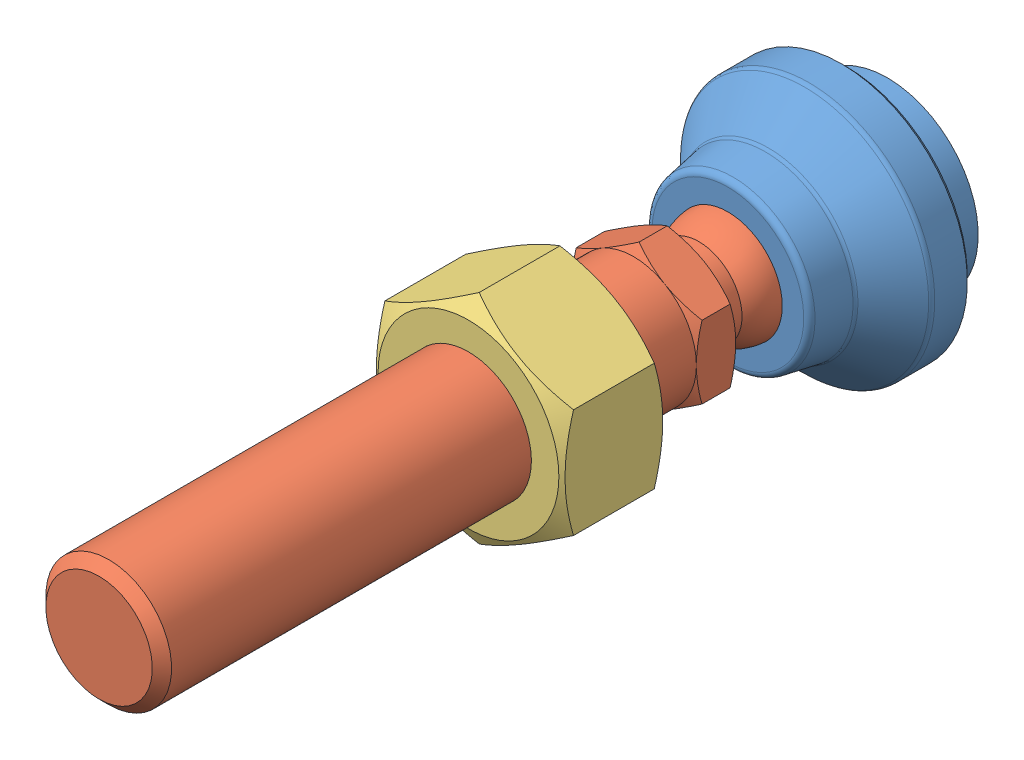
SolidWorks assembly LSVA32-M16X68.sldasm, configuration Default (file format 15000). Lengths in mm.
Overall size (32 32 100.3).
3 component instances, 3 part files, 0 mates.
Components (placement in the parent):
- LSVA32-M16X68_01-1: LSVA32-M16X68_01.SLDPRT [Default] at (0 0 6) x (1 0 0) z (0 -1 0) size (32 20.3 32)
- LSVA32-M16X68_02-1: LSVA32-M16X68_02.sldprt [Default] at (0 0 13.5) x (1 0 0) z (0 -1 0) size (16 87.5 18.48)
- LSVA32-M16X68_03-1: LSVA32-M16X68_03.sldprt [Default] at (0 0 41) size (24 27.71 13)
